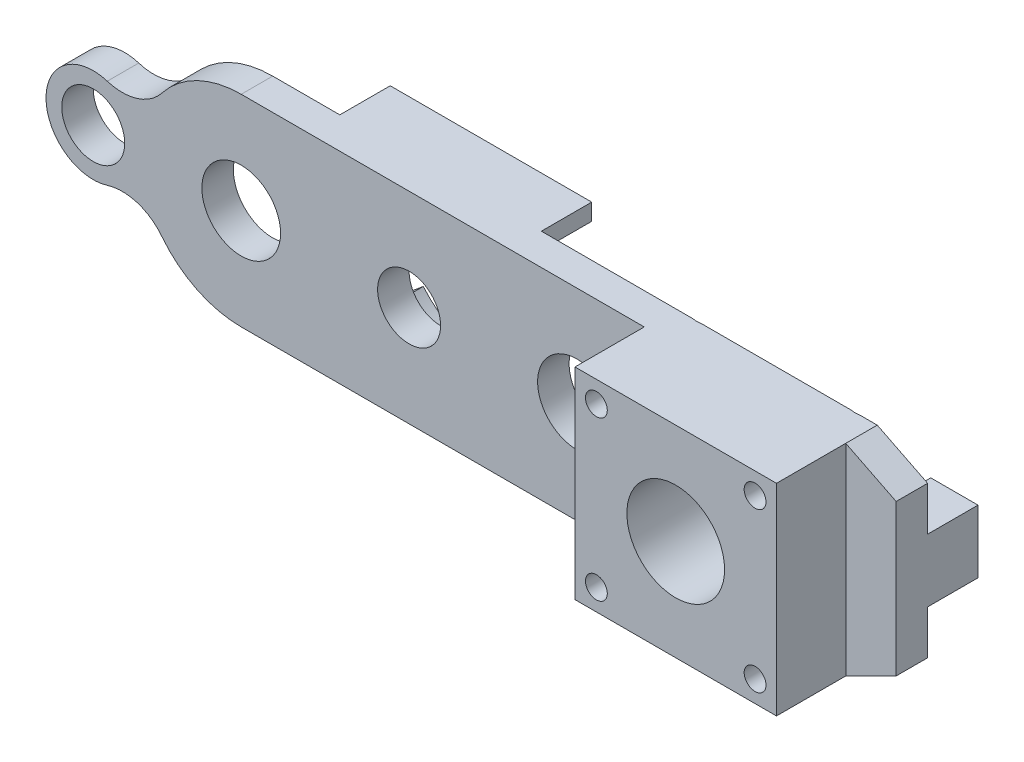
ISO-10303-21;
HEADER;
FILE_DESCRIPTION(('STEP AP214'),'2;1');
FILE_NAME('part.step','',(''),(''),'','','');
FILE_SCHEMA(('AUTOMOTIVE_DESIGN { 1 0 10303 214 1 1 1 1 }'));
ENDSEC;
DATA;
#1=APPLICATION_CONTEXT('core data for automotive mechanical design processes');
#2=APPLICATION_PROTOCOL_DEFINITION('international standard','automotive_design',2000,#1);
#3=PRODUCT_CONTEXT('',#1,'mechanical');
#4=PRODUCT('Part','Part','',(#3));
#5=PRODUCT_RELATED_PRODUCT_CATEGORY('part','',(#4));
#6=PRODUCT_DEFINITION_FORMATION('','',#4);
#7=PRODUCT_DEFINITION_CONTEXT('part definition',#1,'design');
#8=PRODUCT_DEFINITION('design','',#6,#7);
#9=PRODUCT_DEFINITION_SHAPE('','',#8);
#10=(LENGTH_UNIT() NAMED_UNIT(*) SI_UNIT(.MILLI.,.METRE.));
#11=(NAMED_UNIT(*) PLANE_ANGLE_UNIT() SI_UNIT($,.RADIAN.));
#12=(NAMED_UNIT(*) SI_UNIT($,.STERADIAN.) SOLID_ANGLE_UNIT());
#13=UNCERTAINTY_MEASURE_WITH_UNIT(LENGTH_MEASURE(1.E-05),#10,'distance_accuracy_value','');
#14=(GEOMETRIC_REPRESENTATION_CONTEXT(3) GLOBAL_UNCERTAINTY_ASSIGNED_CONTEXT((#13)) GLOBAL_UNIT_ASSIGNED_CONTEXT((#10,
#11,#12)) REPRESENTATION_CONTEXT('',''));
#15=CARTESIAN_POINT('',(0.,0.,0.));
#16=DIRECTION('',(0.,0.,1.));
#17=DIRECTION('',(1.,0.,0.));
#18=AXIS2_PLACEMENT_3D('',#15,#16,#17);
#19=CARTESIAN_POINT('',(-78.0374468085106,19.5578119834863,0.));
#20=DIRECTION('',(0.,0.,1.));
#21=DIRECTION('',(1.,0.,0.));
#22=AXIS2_PLACEMENT_3D('',#19,#20,#21);
#23=PLANE('',#22);
#24=CARTESIAN_POINT('',(-32.1818,10.16,0.));
#25=DIRECTION('',(0.,0.,1.));
#26=DIRECTION('',(1.,0.,0.));
#27=AXIS2_PLACEMENT_3D('',#24,#25,#26);
#28=CIRCLE('',#27,3.96875);
#29=CARTESIAN_POINT('',(-28.21305,10.16,0.));
#30=VERTEX_POINT('',#29);
#31=EDGE_CURVE('E566',#30,#30,#28,.T.);
#32=ORIENTED_EDGE('',*,*,#31,.T.);
#33=EDGE_LOOP('',(#32));
#34=FACE_BOUND('',#33,.T.);
#35=CARTESIAN_POINT('',(-80.9625,10.16,0.));
#36=DIRECTION('',(0.,0.,1.));
#37=DIRECTION('',(1.,0.,0.));
#38=AXIS2_PLACEMENT_3D('',#35,#36,#37);
#39=CIRCLE('',#38,3.175);
#40=CARTESIAN_POINT('',(-77.7875,10.16,0.));
#41=VERTEX_POINT('',#40);
#42=EDGE_CURVE('E576',#41,#41,#39,.T.);
#43=ORIENTED_EDGE('',*,*,#42,.T.);
#44=EDGE_LOOP('',(#43));
#45=FACE_BOUND('',#44,.T.);
#46=CARTESIAN_POINT('',(-66.04,10.16,0.));
#47=DIRECTION('',(0.,0.,1.));
#48=DIRECTION('',(1.,0.,0.));
#49=AXIS2_PLACEMENT_3D('',#46,#47,#48);
#50=CIRCLE('',#49,3.96875);
#51=CARTESIAN_POINT('',(-62.07125,10.16,0.));
#52=VERTEX_POINT('',#51);
#53=EDGE_CURVE('E580',#52,#52,#50,.T.);
#54=ORIENTED_EDGE('',*,*,#53,.T.);
#55=EDGE_LOOP('',(#54));
#56=FACE_BOUND('',#55,.T.);
#57=CARTESIAN_POINT('',(-15.24,10.16,0.));
#58=DIRECTION('',(0.,0.,1.));
#59=DIRECTION('',(1.,0.,0.));
#60=AXIS2_PLACEMENT_3D('',#57,#58,#59);
#61=CIRCLE('',#60,4.92589924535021);
#62=CARTESIAN_POINT('',(-10.3141007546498,10.16,0.));
#63=VERTEX_POINT('',#62);
#64=EDGE_CURVE('E571',#63,#63,#61,.T.);
#65=ORIENTED_EDGE('',*,*,#64,.T.);
#66=EDGE_LOOP('',(#65));
#67=FACE_BOUND('',#66,.T.);
#68=CARTESIAN_POINT('',(-49.1109,10.16,0.));
#69=DIRECTION('',(0.,0.,1.));
#70=DIRECTION('',(1.,0.,0.));
#71=AXIS2_PLACEMENT_3D('',#68,#69,#70);
#72=CIRCLE('',#71,3.175);
#73=CARTESIAN_POINT('',(-45.9359,10.16,0.));
#74=VERTEX_POINT('',#73);
#75=EDGE_CURVE('E559',#74,#74,#72,.T.);
#76=ORIENTED_EDGE('',*,*,#75,.T.);
#77=EDGE_LOOP('',(#76));
#78=FACE_BOUND('',#77,.T.);
#79=DIRECTION('',(-1.,0.,0.));
#80=VECTOR('',#79,1.);
#81=CARTESIAN_POINT('',(-4.7625,6.985,0.));
#82=LINE('',#81,#80);
#83=CARTESIAN_POINT('',(0.,6.985,0.));
#84=VERTEX_POINT('',#83);
#85=CARTESIAN_POINT('',(-4.7625,6.985,0.));
#86=VERTEX_POINT('',#85);
#87=EDGE_CURVE('E1034',#84,#86,#82,.T.);
#88=ORIENTED_EDGE('',*,*,#87,.F.);
#89=DIRECTION('',(0.,1.,0.));
#90=VECTOR('',#89,1.);
#91=CARTESIAN_POINT('',(0.,2.54000000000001,0.));
#92=LINE('',#91,#90);
#93=CARTESIAN_POINT('',(0.,2.54000000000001,0.));
#94=VERTEX_POINT('',#93);
#95=EDGE_CURVE('E276',#94,#84,#92,.T.);
#96=ORIENTED_EDGE('',*,*,#95,.F.);
#97=DIRECTION('',(0.894427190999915,0.44721359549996,0.));
#98=VECTOR('',#97,1.);
#99=CARTESIAN_POINT('',(-5.07999999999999,0.,0.));
#100=LINE('',#99,#98);
#101=CARTESIAN_POINT('',(-5.07999999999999,0.,0.));
#102=VERTEX_POINT('',#101);
#103=EDGE_CURVE('E628',#102,#94,#100,.T.);
#104=ORIENTED_EDGE('',*,*,#103,.F.);
#105=DIRECTION('',(1.,0.,0.));
#106=VECTOR('',#105,1.);
#107=CARTESIAN_POINT('',(-66.04,0.,0.));
#108=LINE('',#107,#106);
#109=CARTESIAN_POINT('',(-6.81624829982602,0.,0.));
#110=VERTEX_POINT('',#109);
#111=EDGE_CURVE('E625',#110,#102,#108,.T.);
#112=ORIENTED_EDGE('',*,*,#111,.F.);
#113=CARTESIAN_POINT('',(-7.23899999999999,2.159,0.));
#114=DIRECTION('',(0.,0.,-1.));
#115=DIRECTION('',(-1.,0.,0.));
#116=AXIS2_PLACEMENT_3D('',#113,#114,#115);
#117=CIRCLE('',#116,2.2);
#118=CARTESIAN_POINT('',(-7.66175170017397,0.,0.));
#119=VERTEX_POINT('',#118);
#120=EDGE_CURVE('E377',#119,#110,#117,.T.);
#121=ORIENTED_EDGE('',*,*,#120,.F.);
#122=CARTESIAN_POINT('',(-22.818248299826,0.,0.));
#123=VERTEX_POINT('',#122);
#124=EDGE_CURVE('E1042',#123,#119,#108,.T.);
#125=ORIENTED_EDGE('',*,*,#124,.F.);
#126=CARTESIAN_POINT('',(-23.241,2.15900000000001,0.));
#127=DIRECTION('',(0.,0.,-1.));
#128=DIRECTION('',(-1.,0.,0.));
#129=AXIS2_PLACEMENT_3D('',#126,#127,#128);
#130=CIRCLE('',#129,2.2);
#131=CARTESIAN_POINT('',(-23.663751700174,0.,0.));
#132=VERTEX_POINT('',#131);
#133=EDGE_CURVE('E371',#132,#123,#130,.T.);
#134=ORIENTED_EDGE('',*,*,#133,.F.);
#135=CARTESIAN_POINT('',(-38.9509,0.,0.));
#136=VERTEX_POINT('',#135);
#137=EDGE_CURVE('E629',#136,#132,#108,.T.);
#138=ORIENTED_EDGE('',*,*,#137,.F.);
#139=DIRECTION('',(0.,-1.,0.));
#140=VECTOR('',#139,1.);
#141=CARTESIAN_POINT('',(-38.9509,0.,0.));
#142=LINE('',#141,#140);
#143=CARTESIAN_POINT('',(-38.9509,1.67881198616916,0.));
#144=VERTEX_POINT('',#143);
#145=EDGE_CURVE('E289',#144,#136,#142,.T.);
#146=ORIENTED_EDGE('',*,*,#145,.F.);
#147=DIRECTION('',(0.767681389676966,-0.640831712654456,0.));
#148=VECTOR('',#147,1.);
#149=CARTESIAN_POINT('',(-38.9509,1.67881198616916,0.));
#150=LINE('',#149,#148);
#151=CARTESIAN_POINT('',(-42.2862124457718,4.46300607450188,0.));
#152=VERTEX_POINT('',#151);
#153=EDGE_CURVE('E302',#152,#144,#150,.T.);
#154=ORIENTED_EDGE('',*,*,#153,.F.);
#155=CARTESIAN_POINT('',(-49.1109,10.16,0.));
#156=DIRECTION('',(0.,0.,1.));
#157=DIRECTION('',(1.,0.,0.));
#158=AXIS2_PLACEMENT_3D('',#155,#156,#157);
#159=CIRCLE('',#158,8.89);
#160=CARTESIAN_POINT('',(-55.9355875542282,4.4630060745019,0.));
#161=VERTEX_POINT('',#160);
#162=EDGE_CURVE('E300',#161,#152,#159,.T.);
#163=ORIENTED_EDGE('',*,*,#162,.F.);
#164=DIRECTION('',(0.767681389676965,0.640831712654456,0.));
#165=VECTOR('',#164,1.);
#166=CARTESIAN_POINT('',(-59.2709,1.67881198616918,0.));
#167=LINE('',#166,#165);
#168=CARTESIAN_POINT('',(-59.2709,1.67881198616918,0.));
#169=VERTEX_POINT('',#168);
#170=EDGE_CURVE('E279',#169,#161,#167,.T.);
#171=ORIENTED_EDGE('',*,*,#170,.F.);
#172=DIRECTION('',(0.,1.,0.));
#173=VECTOR('',#172,1.);
#174=CARTESIAN_POINT('',(-59.2709,0.,0.));
#175=LINE('',#174,#173);
#176=CARTESIAN_POINT('',(-59.2709,0.,0.));
#177=VERTEX_POINT('',#176);
#178=EDGE_CURVE('E277',#177,#169,#175,.T.);
#179=ORIENTED_EDGE('',*,*,#178,.F.);
#180=CARTESIAN_POINT('',(-66.04,0.,0.));
#181=VERTEX_POINT('',#180);
#182=EDGE_CURVE('E626',#181,#177,#108,.T.);
#183=ORIENTED_EDGE('',*,*,#182,.F.);
#184=CARTESIAN_POINT('',(-66.04,10.16,0.));
#185=DIRECTION('',(0.,0.,1.));
#186=DIRECTION('',(1.,0.,0.));
#187=AXIS2_PLACEMENT_3D('',#184,#185,#186);
#188=CIRCLE('',#187,10.16);
#189=CARTESIAN_POINT('',(-74.0382978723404,3.89479201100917,0.));
#190=VERTEX_POINT('',#189);
#191=EDGE_CURVE('E623',#190,#181,#188,.T.);
#192=ORIENTED_EDGE('',*,*,#191,.F.);
#193=CARTESIAN_POINT('',(-78.0374468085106,0.762188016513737,0.));
#194=DIRECTION('',(0.,0.,-1.));
#195=DIRECTION('',(-1.,0.,0.));
#196=AXIS2_PLACEMENT_3D('',#193,#194,#195);
#197=CIRCLE('',#196,5.08);
#198=CARTESIAN_POINT('',(-79.5471516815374,5.61267162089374,0.));
#199=VERTEX_POINT('',#198);
#200=EDGE_CURVE('E621',#199,#190,#197,.T.);
#201=ORIENTED_EDGE('',*,*,#200,.F.);
#202=CARTESIAN_POINT('',(-80.9625,10.16,0.));
#203=DIRECTION('',(0.,0.,1.));
#204=DIRECTION('',(1.,0.,0.));
#205=AXIS2_PLACEMENT_3D('',#202,#203,#204);
#206=CIRCLE('',#205,4.7625);
#207=CARTESIAN_POINT('',(-79.5471516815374,14.7073283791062,0.));
#208=VERTEX_POINT('',#207);
#209=EDGE_CURVE('E619',#208,#199,#206,.T.);
#210=ORIENTED_EDGE('',*,*,#209,.F.);
#211=CARTESIAN_POINT('',(-78.0374468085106,19.5578119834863,0.));
#212=DIRECTION('',(0.,0.,-1.));
#213=DIRECTION('',(1.,0.,0.));
#214=AXIS2_PLACEMENT_3D('',#211,#212,#213);
#215=CIRCLE('',#214,5.07999999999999);
#216=CARTESIAN_POINT('',(-74.0382978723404,16.4252079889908,0.));
#217=VERTEX_POINT('',#216);
#218=EDGE_CURVE('E586',#217,#208,#215,.T.);
#219=ORIENTED_EDGE('',*,*,#218,.F.);
#220=CARTESIAN_POINT('',(-66.04,10.16,0.));
#221=DIRECTION('',(0.,0.,1.));
#222=DIRECTION('',(1.,0.,0.));
#223=AXIS2_PLACEMENT_3D('',#220,#221,#222);
#224=CIRCLE('',#223,10.16);
#225=CARTESIAN_POINT('',(-66.04,20.32,0.));
#226=VERTEX_POINT('',#225);
#227=EDGE_CURVE('E593',#226,#217,#224,.T.);
#228=ORIENTED_EDGE('',*,*,#227,.F.);
#229=DIRECTION('',(-1.,0.,0.));
#230=VECTOR('',#229,1.);
#231=CARTESIAN_POINT('',(-66.04,20.32,0.));
#232=LINE('',#231,#230);
#233=CARTESIAN_POINT('',(-59.2709,20.32,0.));
#234=VERTEX_POINT('',#233);
#235=EDGE_CURVE('E635',#234,#226,#232,.T.);
#236=ORIENTED_EDGE('',*,*,#235,.F.);
#237=DIRECTION('',(0.,1.,0.));
#238=VECTOR('',#237,1.);
#239=CARTESIAN_POINT('',(-59.2709,20.32,0.));
#240=LINE('',#239,#238);
#241=CARTESIAN_POINT('',(-59.2709,18.6411880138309,0.));
#242=VERTEX_POINT('',#241);
#243=EDGE_CURVE('E340',#242,#234,#240,.T.);
#244=ORIENTED_EDGE('',*,*,#243,.F.);
#245=DIRECTION('',(-0.767681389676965,0.640831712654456,0.));
#246=VECTOR('',#245,1.);
#247=CARTESIAN_POINT('',(-59.2709,18.6411880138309,0.));
#248=LINE('',#247,#246);
#249=CARTESIAN_POINT('',(-55.9355875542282,15.8569939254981,0.));
#250=VERTEX_POINT('',#249);
#251=EDGE_CURVE('E338',#250,#242,#248,.T.);
#252=ORIENTED_EDGE('',*,*,#251,.F.);
#253=CARTESIAN_POINT('',(-49.1109,10.16,0.));
#254=DIRECTION('',(0.,0.,1.));
#255=DIRECTION('',(-1.,0.,0.));
#256=AXIS2_PLACEMENT_3D('',#253,#254,#255);
#257=CIRCLE('',#256,8.89);
#258=CARTESIAN_POINT('',(-42.2862124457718,15.8569939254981,0.));
#259=VERTEX_POINT('',#258);
#260=EDGE_CURVE('E320',#259,#250,#257,.T.);
#261=ORIENTED_EDGE('',*,*,#260,.F.);
#262=DIRECTION('',(-0.767681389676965,-0.640831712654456,0.));
#263=VECTOR('',#262,1.);
#264=CARTESIAN_POINT('',(-38.9509,18.6411880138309,0.));
#265=LINE('',#264,#263);
#266=CARTESIAN_POINT('',(-38.9509,18.6411880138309,0.));
#267=VERTEX_POINT('',#266);
#268=EDGE_CURVE('E325',#267,#259,#265,.T.);
#269=ORIENTED_EDGE('',*,*,#268,.F.);
#270=DIRECTION('',(0.,-1.,0.));
#271=VECTOR('',#270,1.);
#272=CARTESIAN_POINT('',(-38.9509,20.32,0.));
#273=LINE('',#272,#271);
#274=CARTESIAN_POINT('',(-38.9509,20.32,0.));
#275=VERTEX_POINT('',#274);
#276=EDGE_CURVE('E343',#275,#267,#273,.T.);
#277=ORIENTED_EDGE('',*,*,#276,.F.);
#278=CARTESIAN_POINT('',(-23.6637517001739,20.32,0.));
#279=VERTEX_POINT('',#278);
#280=EDGE_CURVE('E640',#279,#275,#232,.T.);
#281=ORIENTED_EDGE('',*,*,#280,.F.);
#282=CARTESIAN_POINT('',(-23.241,18.161,0.));
#283=DIRECTION('',(0.,0.,-1.));
#284=DIRECTION('',(-1.,0.,0.));
#285=AXIS2_PLACEMENT_3D('',#282,#283,#284);
#286=CIRCLE('',#285,2.2);
#287=CARTESIAN_POINT('',(-22.8182482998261,20.32,0.));
#288=VERTEX_POINT('',#287);
#289=EDGE_CURVE('E365',#288,#279,#286,.T.);
#290=ORIENTED_EDGE('',*,*,#289,.F.);
#291=CARTESIAN_POINT('',(-7.66175170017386,20.32,0.));
#292=VERTEX_POINT('',#291);
#293=EDGE_CURVE('E639',#292,#288,#232,.T.);
#294=ORIENTED_EDGE('',*,*,#293,.F.);
#295=CARTESIAN_POINT('',(-7.239,18.161,0.));
#296=DIRECTION('',(0.,0.,-1.));
#297=DIRECTION('',(-1.,0.,0.));
#298=AXIS2_PLACEMENT_3D('',#295,#296,#297);
#299=CIRCLE('',#298,2.2);
#300=CARTESIAN_POINT('',(-6.81624829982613,20.32,0.));
#301=VERTEX_POINT('',#300);
#302=EDGE_CURVE('E360',#301,#292,#299,.T.);
#303=ORIENTED_EDGE('',*,*,#302,.F.);
#304=CARTESIAN_POINT('',(-5.07999999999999,20.32,0.));
#305=VERTEX_POINT('',#304);
#306=EDGE_CURVE('E636',#305,#301,#232,.T.);
#307=ORIENTED_EDGE('',*,*,#306,.F.);
#308=DIRECTION('',(-0.894427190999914,0.447213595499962,0.));
#309=VECTOR('',#308,1.);
#310=CARTESIAN_POINT('',(-5.07999999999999,20.32,0.));
#311=LINE('',#310,#309);
#312=CARTESIAN_POINT('',(0.,17.78,0.));
#313=VERTEX_POINT('',#312);
#314=EDGE_CURVE('E633',#313,#305,#311,.T.);
#315=ORIENTED_EDGE('',*,*,#314,.F.);
#316=CARTESIAN_POINT('',(0.,13.335,0.));
#317=VERTEX_POINT('',#316);
#318=EDGE_CURVE('E631',#317,#313,#92,.T.);
#319=ORIENTED_EDGE('',*,*,#318,.F.);
#320=DIRECTION('',(1.,0.,0.));
#321=VECTOR('',#320,1.);
#322=CARTESIAN_POINT('',(0.,13.335,0.));
#323=LINE('',#322,#321);
#324=CARTESIAN_POINT('',(-4.7625,13.335,0.));
#325=VERTEX_POINT('',#324);
#326=EDGE_CURVE('E270',#325,#317,#323,.T.);
#327=ORIENTED_EDGE('',*,*,#326,.F.);
#328=DIRECTION('',(0.,1.,0.));
#329=VECTOR('',#328,1.);
#330=CARTESIAN_POINT('',(-4.7625,13.335,0.));
#331=LINE('',#330,#329);
#332=EDGE_CURVE('E1022',#86,#325,#331,.T.);
#333=ORIENTED_EDGE('',*,*,#332,.F.);
#334=EDGE_LOOP('',(#88,#96,#104,#112,#121,#125,#134,#138,#146,#154,#163,#171,#179,#183,#192,
#201,#210,#219,#228,#236,#244,#252,#261,#269,#277,#281,#290,#294,#303,#307,#315,#319,#327,#333));
#335=FACE_BOUND('',#334,.T.);
#336=ADVANCED_FACE('F37',(#34,#45,#56,#67,#78,#335),#23,.F.);
#337=CARTESIAN_POINT('',(-78.0374468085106,19.5578119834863,3.175));
#338=DIRECTION('',(0.,0.,1.));
#339=DIRECTION('',(1.,0.,0.));
#340=AXIS2_PLACEMENT_3D('',#337,#338,#339);
#341=PLANE('',#340);
#342=DIRECTION('',(0.,1.,0.));
#343=VECTOR('',#342,1.);
#344=CARTESIAN_POINT('',(-5.07999999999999,20.32,3.175));
#345=LINE('',#344,#343);
#346=CARTESIAN_POINT('',(-5.07999999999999,0.,3.175));
#347=VERTEX_POINT('',#346);
#348=CARTESIAN_POINT('',(-5.07999999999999,20.32,3.175));
#349=VERTEX_POINT('',#348);
#350=EDGE_CURVE('E396',#347,#349,#345,.T.);
#351=ORIENTED_EDGE('',*,*,#350,.F.);
#352=DIRECTION('',(0.894427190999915,0.44721359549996,0.));
#353=VECTOR('',#352,1.);
#354=CARTESIAN_POINT('',(-5.07999999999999,0.,3.175));
#355=LINE('',#354,#353);
#356=CARTESIAN_POINT('',(0.,2.54000000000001,3.175));
#357=VERTEX_POINT('',#356);
#358=EDGE_CURVE('E602',#347,#357,#355,.T.);
#359=ORIENTED_EDGE('',*,*,#358,.T.);
#360=DIRECTION('',(0.,1.,0.));
#361=VECTOR('',#360,1.);
#362=CARTESIAN_POINT('',(0.,2.54000000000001,3.175));
#363=LINE('',#362,#361);
#364=CARTESIAN_POINT('',(0.,17.78,3.175));
#365=VERTEX_POINT('',#364);
#366=EDGE_CURVE('E1030',#357,#365,#363,.T.);
#367=ORIENTED_EDGE('',*,*,#366,.T.);
#368=DIRECTION('',(-0.894427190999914,0.447213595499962,0.));
#369=VECTOR('',#368,1.);
#370=CARTESIAN_POINT('',(-5.07999999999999,20.32,3.175));
#371=LINE('',#370,#369);
#372=EDGE_CURVE('E611',#365,#349,#371,.T.);
#373=ORIENTED_EDGE('',*,*,#372,.T.);
#374=EDGE_LOOP('',(#351,#359,#367,#373));
#375=FACE_BOUND('',#374,.T.);
#376=ADVANCED_FACE('F481',(#375),#341,.T.);
#377=DIRECTION('',(0.,-1.,0.));
#378=VECTOR('',#377,1.);
#379=CARTESIAN_POINT('',(-25.4,20.32,3.175));
#380=LINE('',#379,#378);
#381=CARTESIAN_POINT('',(-25.4,20.32,3.175));
#382=VERTEX_POINT('',#381);
#383=CARTESIAN_POINT('',(-25.4,0.,3.175));
#384=VERTEX_POINT('',#383);
#385=EDGE_CURVE('E399',#382,#384,#380,.T.);
#386=ORIENTED_EDGE('',*,*,#385,.F.);
#387=DIRECTION('',(-1.,0.,0.));
#388=VECTOR('',#387,1.);
#389=CARTESIAN_POINT('',(-66.04,20.32,3.175));
#390=LINE('',#389,#388);
#391=CARTESIAN_POINT('',(-66.04,20.32,3.175));
#392=VERTEX_POINT('',#391);
#393=EDGE_CURVE('E608',#382,#392,#390,.T.);
#394=ORIENTED_EDGE('',*,*,#393,.T.);
#395=CARTESIAN_POINT('',(-66.04,10.16,3.175));
#396=DIRECTION('',(0.,0.,1.));
#397=DIRECTION('',(1.,0.,0.));
#398=AXIS2_PLACEMENT_3D('',#395,#396,#397);
#399=CIRCLE('',#398,10.16);
#400=CARTESIAN_POINT('',(-74.0382978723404,16.4252079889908,3.175));
#401=VERTEX_POINT('',#400);
#402=EDGE_CURVE('E610',#392,#401,#399,.T.);
#403=ORIENTED_EDGE('',*,*,#402,.T.);
#404=CARTESIAN_POINT('',(-78.0374468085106,19.5578119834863,3.175));
#405=DIRECTION('',(0.,0.,-1.));
#406=DIRECTION('',(1.,0.,0.));
#407=AXIS2_PLACEMENT_3D('',#404,#405,#406);
#408=CIRCLE('',#407,5.07999999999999);
#409=CARTESIAN_POINT('',(-79.5471516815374,14.7073283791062,3.175));
#410=VERTEX_POINT('',#409);
#411=EDGE_CURVE('E589',#401,#410,#408,.T.);
#412=ORIENTED_EDGE('',*,*,#411,.T.);
#413=CARTESIAN_POINT('',(-80.9625,10.16,3.175));
#414=DIRECTION('',(0.,0.,1.));
#415=DIRECTION('',(1.,0.,0.));
#416=AXIS2_PLACEMENT_3D('',#413,#414,#415);
#417=CIRCLE('',#416,4.7625);
#418=CARTESIAN_POINT('',(-79.5471516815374,5.61267162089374,3.175));
#419=VERTEX_POINT('',#418);
#420=EDGE_CURVE('E592',#410,#419,#417,.T.);
#421=ORIENTED_EDGE('',*,*,#420,.T.);
#422=CARTESIAN_POINT('',(-78.0374468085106,0.762188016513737,3.175));
#423=DIRECTION('',(0.,0.,-1.));
#424=DIRECTION('',(-1.,0.,0.));
#425=AXIS2_PLACEMENT_3D('',#422,#423,#424);
#426=CIRCLE('',#425,5.08);
#427=CARTESIAN_POINT('',(-74.0382978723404,3.89479201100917,3.175));
#428=VERTEX_POINT('',#427);
#429=EDGE_CURVE('E595',#419,#428,#426,.T.);
#430=ORIENTED_EDGE('',*,*,#429,.T.);
#431=CARTESIAN_POINT('',(-66.04,10.16,3.175));
#432=DIRECTION('',(0.,0.,1.));
#433=DIRECTION('',(1.,0.,0.));
#434=AXIS2_PLACEMENT_3D('',#431,#432,#433);
#435=CIRCLE('',#434,10.16);
#436=CARTESIAN_POINT('',(-66.04,0.,3.175));
#437=VERTEX_POINT('',#436);
#438=EDGE_CURVE('E597',#428,#437,#435,.T.);
#439=ORIENTED_EDGE('',*,*,#438,.T.);
#440=DIRECTION('',(1.,0.,0.));
#441=VECTOR('',#440,1.);
#442=CARTESIAN_POINT('',(-66.04,0.,3.175));
#443=LINE('',#442,#441);
#444=EDGE_CURVE('E599',#437,#384,#443,.T.);
#445=ORIENTED_EDGE('',*,*,#444,.T.);
#446=EDGE_LOOP('',(#386,#394,#403,#412,#421,#430,#439,#445));
#447=FACE_BOUND('',#446,.T.);
#448=CARTESIAN_POINT('',(-32.1818,10.16,3.175));
#449=DIRECTION('',(0.,0.,1.));
#450=DIRECTION('',(1.,0.,0.));
#451=AXIS2_PLACEMENT_3D('',#448,#449,#450);
#452=CIRCLE('',#451,3.96875);
#453=CARTESIAN_POINT('',(-28.21305,10.16,3.175));
#454=VERTEX_POINT('',#453);
#455=EDGE_CURVE('E568',#454,#454,#452,.T.);
#456=ORIENTED_EDGE('',*,*,#455,.F.);
#457=EDGE_LOOP('',(#456));
#458=FACE_BOUND('',#457,.T.);
#459=CARTESIAN_POINT('',(-80.9625,10.16,3.175));
#460=DIRECTION('',(0.,0.,1.));
#461=DIRECTION('',(1.,0.,0.));
#462=AXIS2_PLACEMENT_3D('',#459,#460,#461);
#463=CIRCLE('',#462,3.175);
#464=CARTESIAN_POINT('',(-77.7875,10.16,3.175));
#465=VERTEX_POINT('',#464);
#466=EDGE_CURVE('E577',#465,#465,#463,.T.);
#467=ORIENTED_EDGE('',*,*,#466,.F.);
#468=EDGE_LOOP('',(#467));
#469=FACE_BOUND('',#468,.T.);
#470=CARTESIAN_POINT('',(-66.04,10.16,3.175));
#471=DIRECTION('',(0.,0.,1.));
#472=DIRECTION('',(1.,0.,0.));
#473=AXIS2_PLACEMENT_3D('',#470,#471,#472);
#474=CIRCLE('',#473,3.96875);
#475=CARTESIAN_POINT('',(-62.07125,10.16,3.175));
#476=VERTEX_POINT('',#475);
#477=EDGE_CURVE('E583',#476,#476,#474,.T.);
#478=ORIENTED_EDGE('',*,*,#477,.F.);
#479=EDGE_LOOP('',(#478));
#480=FACE_BOUND('',#479,.T.);
#481=CARTESIAN_POINT('',(-49.1109,10.16,3.175));
#482=DIRECTION('',(0.,0.,1.));
#483=DIRECTION('',(1.,0.,0.));
#484=AXIS2_PLACEMENT_3D('',#481,#482,#483);
#485=CIRCLE('',#484,3.175);
#486=CARTESIAN_POINT('',(-45.9359,10.16,3.175));
#487=VERTEX_POINT('',#486);
#488=EDGE_CURVE('E561',#487,#487,#485,.T.);
#489=ORIENTED_EDGE('',*,*,#488,.F.);
#490=EDGE_LOOP('',(#489));
#491=FACE_BOUND('',#490,.T.);
#492=ADVANCED_FACE('F478',(#447,#458,#469,#480,#491),#341,.T.);
#493=CARTESIAN_POINT('',(-78.0374468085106,19.5578119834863,3.175));
#494=DIRECTION('',(0.,0.,-1.));
#495=DIRECTION('',(-1.,0.,0.));
#496=AXIS2_PLACEMENT_3D('',#493,#494,#495);
#497=CYLINDRICAL_SURFACE('',#496,5.07999999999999);
#498=ORIENTED_EDGE('',*,*,#218,.T.);
#499=DIRECTION('',(0.,0.,-1.));
#500=VECTOR('',#499,1.);
#501=CARTESIAN_POINT('',(-79.5471516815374,14.7073283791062,3.175));
#502=LINE('',#501,#500);
#503=EDGE_CURVE('E426',#410,#208,#502,.T.);
#504=ORIENTED_EDGE('',*,*,#503,.F.);
#505=ORIENTED_EDGE('',*,*,#411,.F.);
#506=DIRECTION('',(0.,0.,-1.));
#507=VECTOR('',#506,1.);
#508=CARTESIAN_POINT('',(-74.0382978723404,16.4252079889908,3.175));
#509=LINE('',#508,#507);
#510=EDGE_CURVE('E616',#401,#217,#509,.T.);
#511=ORIENTED_EDGE('',*,*,#510,.T.);
#512=EDGE_LOOP('',(#498,#504,#505,#511));
#513=FACE_BOUND('',#512,.T.);
#514=ADVANCED_FACE('F39',(#513),#497,.F.);
#515=CARTESIAN_POINT('',(-80.9625,10.16,3.175));
#516=DIRECTION('',(0.,0.,-1.));
#517=DIRECTION('',(-1.,0.,0.));
#518=AXIS2_PLACEMENT_3D('',#515,#516,#517);
#519=CYLINDRICAL_SURFACE('',#518,4.7625);
#520=ORIENTED_EDGE('',*,*,#209,.T.);
#521=DIRECTION('',(0.,0.,-1.));
#522=VECTOR('',#521,1.);
#523=CARTESIAN_POINT('',(-79.5471516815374,5.61267162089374,3.175));
#524=LINE('',#523,#522);
#525=EDGE_CURVE('E660',#419,#199,#524,.T.);
#526=ORIENTED_EDGE('',*,*,#525,.F.);
#527=ORIENTED_EDGE('',*,*,#420,.F.);
#528=ORIENTED_EDGE('',*,*,#503,.T.);
#529=EDGE_LOOP('',(#520,#526,#527,#528));
#530=FACE_BOUND('',#529,.T.);
#531=ADVANCED_FACE('F669',(#530),#519,.T.);
#532=CARTESIAN_POINT('',(-78.0374468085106,0.762188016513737,3.175));
#533=DIRECTION('',(0.,0.,-1.));
#534=DIRECTION('',(-1.,0.,0.));
#535=AXIS2_PLACEMENT_3D('',#532,#533,#534);
#536=CYLINDRICAL_SURFACE('',#535,5.08);
#537=ORIENTED_EDGE('',*,*,#200,.T.);
#538=DIRECTION('',(0.,0.,-1.));
#539=VECTOR('',#538,1.);
#540=CARTESIAN_POINT('',(-74.0382978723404,3.89479201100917,3.175));
#541=LINE('',#540,#539);
#542=EDGE_CURVE('E658',#428,#190,#541,.T.);
#543=ORIENTED_EDGE('',*,*,#542,.F.);
#544=ORIENTED_EDGE('',*,*,#429,.F.);
#545=ORIENTED_EDGE('',*,*,#525,.T.);
#546=EDGE_LOOP('',(#537,#543,#544,#545));
#547=FACE_BOUND('',#546,.T.);
#548=ADVANCED_FACE('F680',(#547),#536,.F.);
#549=CARTESIAN_POINT('',(-66.04,10.16,3.175));
#550=DIRECTION('',(0.,0.,-1.));
#551=DIRECTION('',(-1.,0.,0.));
#552=AXIS2_PLACEMENT_3D('',#549,#550,#551);
#553=CYLINDRICAL_SURFACE('',#552,10.16);
#554=ORIENTED_EDGE('',*,*,#191,.T.);
#555=DIRECTION('',(0.,0.,-1.));
#556=VECTOR('',#555,1.);
#557=CARTESIAN_POINT('',(-66.04,0.,3.175));
#558=LINE('',#557,#556);
#559=EDGE_CURVE('E655',#437,#181,#558,.T.);
#560=ORIENTED_EDGE('',*,*,#559,.F.);
#561=ORIENTED_EDGE('',*,*,#438,.F.);
#562=ORIENTED_EDGE('',*,*,#542,.T.);
#563=EDGE_LOOP('',(#554,#560,#561,#562));
#564=FACE_BOUND('',#563,.T.);
#565=ADVANCED_FACE('F683',(#564),#553,.T.);
#566=CARTESIAN_POINT('',(-66.04,0.,3.175));
#567=DIRECTION('',(0.,1.,0.));
#568=DIRECTION('',(-1.,0.,0.));
#569=AXIS2_PLACEMENT_3D('',#566,#567,#568);
#570=PLANE('',#569);
#571=ORIENTED_EDGE('',*,*,#182,.T.);
#572=DIRECTION('',(0.,0.,1.));
#573=VECTOR('',#572,1.);
#574=CARTESIAN_POINT('',(-59.2709,0.,-5.08));
#575=LINE('',#574,#573);
#576=CARTESIAN_POINT('',(-59.2709,0.,-5.08));
#577=VERTEX_POINT('',#576);
#578=EDGE_CURVE('E318',#577,#177,#575,.T.);
#579=ORIENTED_EDGE('',*,*,#578,.F.);
#580=DIRECTION('',(-1.,0.,0.));
#581=VECTOR('',#580,1.);
#582=CARTESIAN_POINT('',(-59.2709,0.,-5.08));
#583=LINE('',#582,#581);
#584=CARTESIAN_POINT('',(-38.9509,0.,-5.08));
#585=VERTEX_POINT('',#584);
#586=EDGE_CURVE('E285',#585,#577,#583,.T.);
#587=ORIENTED_EDGE('',*,*,#586,.F.);
#588=DIRECTION('',(0.,0.,1.));
#589=VECTOR('',#588,1.);
#590=CARTESIAN_POINT('',(-38.9509,0.,-5.08));
#591=LINE('',#590,#589);
#592=EDGE_CURVE('E61',#585,#136,#591,.T.);
#593=ORIENTED_EDGE('',*,*,#592,.T.);
#594=ORIENTED_EDGE('',*,*,#137,.T.);
#595=CARTESIAN_POINT('',(-23.6647912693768,0.,-0.000200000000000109));
#596=CARTESIAN_POINT('',(-23.6109499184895,0.,0.0101956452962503));
#597=CARTESIAN_POINT('',(-23.5567305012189,0.,0.0187127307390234));
#598=CARTESIAN_POINT('',(-23.4477943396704,0.,0.0317865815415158));
#599=CARTESIAN_POINT('',(-23.393077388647,0.,0.0363416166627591));
#600=CARTESIAN_POINT('',(-23.2842169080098,0.,0.0412443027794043));
#601=CARTESIAN_POINT('',(-23.2300760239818,0.,0.041649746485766));
#602=CARTESIAN_POINT('',(-23.1219418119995,0.,0.0383943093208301));
#603=CARTESIAN_POINT('',(-23.0679484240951,0.,0.0347354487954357));
#604=CARTESIAN_POINT('',(-22.981219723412,0.,0.025674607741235));
#605=CARTESIAN_POINT('',(-22.9483506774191,0.,0.0214966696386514));
#606=CARTESIAN_POINT('',(-22.8826798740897,0.,0.0117098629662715));
#607=CARTESIAN_POINT('',(-22.8498790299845,0.,0.00609485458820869));
#608=CARTESIAN_POINT('',(-22.8172087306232,0.,-0.00020000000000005));
#609=B_SPLINE_CURVE_WITH_KNOTS('',3,(#595,#596,#597,#598,#599,#600,#601,#602,#603,#604,#605,
#606,#607,#608),.UNSPECIFIED.,.F.,.F.,(4,2,2,2,2,2,4),(0.,0.164497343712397,0.329066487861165,
0.491340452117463,0.653533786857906,0.752906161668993,0.852710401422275),.UNSPECIFIED.);
#610=EDGE_CURVE('E425',#132,#123,#609,.T.);
#611=ORIENTED_EDGE('',*,*,#610,.T.);
#612=ORIENTED_EDGE('',*,*,#124,.T.);
#613=CARTESIAN_POINT('',(-7.66279126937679,0.,-0.000200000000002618));
#614=CARTESIAN_POINT('',(-7.6089499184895,0.,0.0101956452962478));
#615=CARTESIAN_POINT('',(-7.55473050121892,0.,0.0187127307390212));
#616=CARTESIAN_POINT('',(-7.44579433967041,0.,0.0317865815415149));
#617=CARTESIAN_POINT('',(-7.39107738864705,0.,0.036341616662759));
#618=CARTESIAN_POINT('',(-7.28221690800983,0.,0.0412443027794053));
#619=CARTESIAN_POINT('',(-7.22807602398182,0.,0.0416497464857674));
#620=CARTESIAN_POINT('',(-7.11994181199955,0.,0.0383943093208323));
#621=CARTESIAN_POINT('',(-7.06594842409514,0.,0.0347354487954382));
#622=CARTESIAN_POINT('',(-6.97921972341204,0.,0.025674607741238));
#623=CARTESIAN_POINT('',(-6.94635067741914,0.,0.0214966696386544));
#624=CARTESIAN_POINT('',(-6.88067987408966,0.,0.0117098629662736));
#625=CARTESIAN_POINT('',(-6.84787902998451,0.,0.00609485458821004));
#626=CARTESIAN_POINT('',(-6.81520873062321,0.,-0.000200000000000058));
#627=B_SPLINE_CURVE_WITH_KNOTS('',3,(#613,#614,#615,#616,#617,#618,#619,#620,#621,#622,#623,
#624,#625,#626),.UNSPECIFIED.,.F.,.F.,(4,2,2,2,2,2,4),(0.,0.164497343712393,0.329066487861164,
0.491340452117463,0.653533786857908,0.752906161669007,0.852710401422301),.UNSPECIFIED.);
#628=EDGE_CURVE('E417',#119,#110,#627,.T.);
#629=ORIENTED_EDGE('',*,*,#628,.T.);
#630=ORIENTED_EDGE('',*,*,#111,.T.);
#631=DIRECTION('',(0.,0.,-1.));
#632=VECTOR('',#631,1.);
#633=CARTESIAN_POINT('',(-5.07999999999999,0.,3.175));
#634=LINE('',#633,#632);
#635=EDGE_CURVE('E554',#347,#102,#634,.T.);
#636=ORIENTED_EDGE('',*,*,#635,.F.);
#637=DIRECTION('',(0.,0.,-1.));
#638=VECTOR('',#637,1.);
#639=CARTESIAN_POINT('',(-5.07999999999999,0.,49.0568195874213));
#640=LINE('',#639,#638);
#641=CARTESIAN_POINT('',(-5.07999999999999,0.,10.16));
#642=VERTEX_POINT('',#641);
#643=EDGE_CURVE('E402',#642,#347,#640,.T.);
#644=ORIENTED_EDGE('',*,*,#643,.F.);
#645=DIRECTION('',(1.,0.,0.));
#646=VECTOR('',#645,1.);
#647=CARTESIAN_POINT('',(-5.07999999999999,0.,10.16));
#648=LINE('',#647,#646);
#649=CARTESIAN_POINT('',(-25.4,0.,10.16));
#650=VERTEX_POINT('',#649);
#651=EDGE_CURVE('E383',#650,#642,#648,.T.);
#652=ORIENTED_EDGE('',*,*,#651,.F.);
#653=DIRECTION('',(0.,0.,-1.));
#654=VECTOR('',#653,1.);
#655=CARTESIAN_POINT('',(-25.4,0.,49.0568195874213));
#656=LINE('',#655,#654);
#657=EDGE_CURVE('E414',#650,#384,#656,.T.);
#658=ORIENTED_EDGE('',*,*,#657,.T.);
#659=ORIENTED_EDGE('',*,*,#444,.F.);
#660=ORIENTED_EDGE('',*,*,#559,.T.);
#661=EDGE_LOOP('',(#571,#579,#587,#593,#594,#611,#612,#629,#630,#636,#644,#652,#658,#659,#660));
#662=FACE_BOUND('',#661,.T.);
#663=ADVANCED_FACE('F428',(#662),#570,.F.);
#664=CARTESIAN_POINT('',(-5.07999999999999,0.,3.175));
#665=DIRECTION('',(-0.44721359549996,0.894427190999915,0.));
#666=DIRECTION('',(-0.894427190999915,-0.44721359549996,0.));
#667=AXIS2_PLACEMENT_3D('',#664,#665,#666);
#668=PLANE('',#667);
#669=ORIENTED_EDGE('',*,*,#103,.T.);
#670=DIRECTION('',(0.,0.,-1.));
#671=VECTOR('',#670,1.);
#672=CARTESIAN_POINT('',(0.,2.54000000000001,3.175));
#673=LINE('',#672,#671);
#674=EDGE_CURVE('E652',#357,#94,#673,.T.);
#675=ORIENTED_EDGE('',*,*,#674,.F.);
#676=ORIENTED_EDGE('',*,*,#358,.F.);
#677=ORIENTED_EDGE('',*,*,#635,.T.);
#678=EDGE_LOOP('',(#669,#675,#676,#677));
#679=FACE_BOUND('',#678,.T.);
#680=ADVANCED_FACE('F832',(#679),#668,.F.);
#681=CARTESIAN_POINT('',(0.,2.54000000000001,3.175));
#682=DIRECTION('',(-1.,0.,0.));
#683=DIRECTION('',(0.,-1.,0.));
#684=AXIS2_PLACEMENT_3D('',#681,#682,#683);
#685=PLANE('',#684);
#686=ORIENTED_EDGE('',*,*,#95,.T.);
#687=DIRECTION('',(0.,0.,1.));
#688=VECTOR('',#687,1.);
#689=CARTESIAN_POINT('',(0.,6.985,-5.08));
#690=LINE('',#689,#688);
#691=CARTESIAN_POINT('',(0.,6.985,-5.08));
#692=VERTEX_POINT('',#691);
#693=EDGE_CURVE('E258',#692,#84,#690,.T.);
#694=ORIENTED_EDGE('',*,*,#693,.F.);
#695=DIRECTION('',(0.,-1.,0.));
#696=VECTOR('',#695,1.);
#697=CARTESIAN_POINT('',(0.,6.985,-5.08));
#698=LINE('',#697,#696);
#699=CARTESIAN_POINT('',(0.,13.335,-5.08));
#700=VERTEX_POINT('',#699);
#701=EDGE_CURVE('E265',#700,#692,#698,.T.);
#702=ORIENTED_EDGE('',*,*,#701,.F.);
#703=DIRECTION('',(0.,0.,1.));
#704=VECTOR('',#703,1.);
#705=CARTESIAN_POINT('',(0.,13.335,-5.08));
#706=LINE('',#705,#704);
#707=EDGE_CURVE('E53',#700,#317,#706,.T.);
#708=ORIENTED_EDGE('',*,*,#707,.T.);
#709=ORIENTED_EDGE('',*,*,#318,.T.);
#710=DIRECTION('',(0.,0.,-1.));
#711=VECTOR('',#710,1.);
#712=CARTESIAN_POINT('',(0.,17.78,3.175));
#713=LINE('',#712,#711);
#714=EDGE_CURVE('E649',#365,#313,#713,.T.);
#715=ORIENTED_EDGE('',*,*,#714,.F.);
#716=ORIENTED_EDGE('',*,*,#366,.F.);
#717=ORIENTED_EDGE('',*,*,#674,.T.);
#718=EDGE_LOOP('',(#686,#694,#702,#708,#709,#715,#716,#717));
#719=FACE_BOUND('',#718,.T.);
#720=ADVANCED_FACE('F273',(#719),#685,.F.);
#721=CARTESIAN_POINT('',(-5.07999999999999,20.32,3.175));
#722=DIRECTION('',(-0.447213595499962,-0.894427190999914,0.));
#723=DIRECTION('',(0.894427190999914,-0.447213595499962,0.));
#724=AXIS2_PLACEMENT_3D('',#721,#722,#723);
#725=PLANE('',#724);
#726=ORIENTED_EDGE('',*,*,#314,.T.);
#727=DIRECTION('',(0.,0.,-1.));
#728=VECTOR('',#727,1.);
#729=CARTESIAN_POINT('',(-5.07999999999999,20.32,3.175));
#730=LINE('',#729,#728);
#731=EDGE_CURVE('E647',#349,#305,#730,.T.);
#732=ORIENTED_EDGE('',*,*,#731,.F.);
#733=ORIENTED_EDGE('',*,*,#372,.F.);
#734=ORIENTED_EDGE('',*,*,#714,.T.);
#735=EDGE_LOOP('',(#726,#732,#733,#734));
#736=FACE_BOUND('',#735,.T.);
#737=ADVANCED_FACE('F493',(#736),#725,.F.);
#738=CARTESIAN_POINT('',(-66.04,20.32,3.175));
#739=DIRECTION('',(0.,-1.,0.));
#740=DIRECTION('',(1.,0.,0.));
#741=AXIS2_PLACEMENT_3D('',#738,#739,#740);
#742=PLANE('',#741);
#743=ORIENTED_EDGE('',*,*,#306,.T.);
#744=CARTESIAN_POINT('',(-6.81520873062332,20.32,-0.00020000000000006));
#745=CARTESIAN_POINT('',(-6.86905008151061,20.32,0.0101956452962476));
#746=CARTESIAN_POINT('',(-6.92326949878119,20.32,0.0187127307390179));
#747=CARTESIAN_POINT('',(-7.0322056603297,20.32,0.0317865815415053));
#748=CARTESIAN_POINT('',(-7.08692261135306,20.32,0.0363416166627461));
#749=CARTESIAN_POINT('',(-7.19578309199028,20.32,0.0412443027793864));
#750=CARTESIAN_POINT('',(-7.24992397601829,20.32,0.0416497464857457));
#751=CARTESIAN_POINT('',(-7.35805818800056,20.32,0.0383943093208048));
#752=CARTESIAN_POINT('',(-7.41205157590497,20.32,0.0347354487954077));
#753=CARTESIAN_POINT('',(-7.49878027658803,20.32,0.0256746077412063));
#754=CARTESIAN_POINT('',(-7.5316493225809,20.32,0.0214966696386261));
#755=CARTESIAN_POINT('',(-7.59732012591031,20.32,0.0117098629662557));
#756=CARTESIAN_POINT('',(-7.63012097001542,20.32,0.00609485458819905));
#757=CARTESIAN_POINT('',(-7.66279126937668,20.32,-0.00020000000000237));
#758=B_SPLINE_CURVE_WITH_KNOTS('',3,(#744,#745,#746,#747,#748,#749,#750,#751,#752,#753,#754,
#755,#756,#757),.UNSPECIFIED.,.F.,.F.,(4,2,2,2,2,2,4),(0.,0.164497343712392,0.329066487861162,
0.491340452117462,0.653533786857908,0.752906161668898,0.852710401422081),.UNSPECIFIED.);
#759=EDGE_CURVE('E12',#301,#292,#758,.T.);
#760=ORIENTED_EDGE('',*,*,#759,.T.);
#761=ORIENTED_EDGE('',*,*,#293,.T.);
#762=CARTESIAN_POINT('',(-22.8172087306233,20.32,-0.000200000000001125));
#763=CARTESIAN_POINT('',(-22.8710500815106,20.32,0.0101956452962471));
#764=CARTESIAN_POINT('',(-22.9252694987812,20.32,0.0187127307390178));
#765=CARTESIAN_POINT('',(-23.0342056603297,20.32,0.0317865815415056));
#766=CARTESIAN_POINT('',(-23.0889226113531,20.32,0.0363416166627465));
#767=CARTESIAN_POINT('',(-23.1977830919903,20.32,0.0412443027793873));
#768=CARTESIAN_POINT('',(-23.2519239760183,20.32,0.0416497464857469));
#769=CARTESIAN_POINT('',(-23.3600581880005,20.32,0.0383943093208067));
#770=CARTESIAN_POINT('',(-23.414051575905,20.32,0.0347354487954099));
#771=CARTESIAN_POINT('',(-23.500780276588,20.32,0.0256746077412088));
#772=CARTESIAN_POINT('',(-23.5336493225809,20.32,0.0214966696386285));
#773=CARTESIAN_POINT('',(-23.5993201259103,20.32,0.0117098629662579));
#774=CARTESIAN_POINT('',(-23.6321209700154,20.32,0.00609485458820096));
#775=CARTESIAN_POINT('',(-23.6647912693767,20.32,-0.000200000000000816));
#776=B_SPLINE_CURVE_WITH_KNOTS('',3,(#762,#763,#764,#765,#766,#767,#768,#769,#770,#771,#772,
#773,#774,#775),.UNSPECIFIED.,.F.,.F.,(4,2,2,2,2,2,4),(0.,0.164497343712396,0.329066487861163,
0.491340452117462,0.653533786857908,0.752906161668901,0.852710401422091),.UNSPECIFIED.);
#777=EDGE_CURVE('E46',#288,#279,#776,.T.);
#778=ORIENTED_EDGE('',*,*,#777,.T.);
#779=ORIENTED_EDGE('',*,*,#280,.T.);
#780=DIRECTION('',(0.,0.,1.));
#781=VECTOR('',#780,1.);
#782=CARTESIAN_POINT('',(-38.9509,20.32,-5.08));
#783=LINE('',#782,#781);
#784=CARTESIAN_POINT('',(-38.9509,20.32,-5.08));
#785=VERTEX_POINT('',#784);
#786=EDGE_CURVE('E351',#785,#275,#783,.T.);
#787=ORIENTED_EDGE('',*,*,#786,.F.);
#788=DIRECTION('',(1.,0.,0.));
#789=VECTOR('',#788,1.);
#790=CARTESIAN_POINT('',(-59.2709,20.32,-5.08));
#791=LINE('',#790,#789);
#792=CARTESIAN_POINT('',(-59.2709,20.32,-5.08));
#793=VERTEX_POINT('',#792);
#794=EDGE_CURVE('E329',#793,#785,#791,.T.);
#795=ORIENTED_EDGE('',*,*,#794,.F.);
#796=DIRECTION('',(0.,0.,1.));
#797=VECTOR('',#796,1.);
#798=CARTESIAN_POINT('',(-59.2709,20.32,-5.08));
#799=LINE('',#798,#797);
#800=EDGE_CURVE('E353',#793,#234,#799,.T.);
#801=ORIENTED_EDGE('',*,*,#800,.T.);
#802=ORIENTED_EDGE('',*,*,#235,.T.);
#803=DIRECTION('',(0.,0.,-1.));
#804=VECTOR('',#803,1.);
#805=CARTESIAN_POINT('',(-66.04,20.32,3.175));
#806=LINE('',#805,#804);
#807=EDGE_CURVE('E644',#392,#226,#806,.T.);
#808=ORIENTED_EDGE('',*,*,#807,.F.);
#809=ORIENTED_EDGE('',*,*,#393,.F.);
#810=DIRECTION('',(0.,0.,-1.));
#811=VECTOR('',#810,1.);
#812=CARTESIAN_POINT('',(-25.4,20.32,49.0568195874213));
#813=LINE('',#812,#811);
#814=CARTESIAN_POINT('',(-25.4,20.32,10.16));
#815=VERTEX_POINT('',#814);
#816=EDGE_CURVE('E410',#815,#382,#813,.T.);
#817=ORIENTED_EDGE('',*,*,#816,.F.);
#818=DIRECTION('',(-1.,0.,0.));
#819=VECTOR('',#818,1.);
#820=CARTESIAN_POINT('',(-5.07999999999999,20.32,10.16));
#821=LINE('',#820,#819);
#822=CARTESIAN_POINT('',(-5.07999999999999,20.32,10.16));
#823=VERTEX_POINT('',#822);
#824=EDGE_CURVE('E390',#823,#815,#821,.T.);
#825=ORIENTED_EDGE('',*,*,#824,.F.);
#826=DIRECTION('',(0.,0.,-1.));
#827=VECTOR('',#826,1.);
#828=CARTESIAN_POINT('',(-5.07999999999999,20.32,49.0568195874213));
#829=LINE('',#828,#827);
#830=EDGE_CURVE('E413',#823,#349,#829,.T.);
#831=ORIENTED_EDGE('',*,*,#830,.T.);
#832=ORIENTED_EDGE('',*,*,#731,.T.);
#833=EDGE_LOOP('',(#743,#760,#761,#778,#779,#787,#795,#801,#802,#808,#809,#817,#825,#831,#832));
#834=FACE_BOUND('',#833,.T.);
#835=ADVANCED_FACE('F488',(#834),#742,.F.);
#836=CARTESIAN_POINT('',(-66.04,10.16,3.175));
#837=DIRECTION('',(0.,0.,-1.));
#838=DIRECTION('',(-1.,0.,0.));
#839=AXIS2_PLACEMENT_3D('',#836,#837,#838);
#840=CYLINDRICAL_SURFACE('',#839,10.16);
#841=ORIENTED_EDGE('',*,*,#227,.T.);
#842=ORIENTED_EDGE('',*,*,#510,.F.);
#843=ORIENTED_EDGE('',*,*,#402,.F.);
#844=ORIENTED_EDGE('',*,*,#807,.T.);
#845=EDGE_LOOP('',(#841,#842,#843,#844));
#846=FACE_BOUND('',#845,.T.);
#847=ADVANCED_FACE('F476',(#846),#840,.T.);
#848=CARTESIAN_POINT('',(-66.04,10.16,3.175));
#849=DIRECTION('',(0.,0.,-1.));
#850=DIRECTION('',(-1.,0.,0.));
#851=AXIS2_PLACEMENT_3D('',#848,#849,#850);
#852=CYLINDRICAL_SURFACE('',#851,3.96875);
#853=ORIENTED_EDGE('',*,*,#477,.T.);
#854=EDGE_LOOP('',(#853));
#855=FACE_BOUND('',#854,.T.);
#856=ORIENTED_EDGE('',*,*,#53,.F.);
#857=EDGE_LOOP('',(#856));
#858=FACE_BOUND('',#857,.T.);
#859=ADVANCED_FACE('F472',(#855,#858),#852,.F.);
#860=CARTESIAN_POINT('',(-80.9625,10.16,3.175));
#861=DIRECTION('',(0.,0.,-1.));
#862=DIRECTION('',(-1.,0.,0.));
#863=AXIS2_PLACEMENT_3D('',#860,#861,#862);
#864=CYLINDRICAL_SURFACE('',#863,3.175);
#865=ORIENTED_EDGE('',*,*,#466,.T.);
#866=EDGE_LOOP('',(#865));
#867=FACE_BOUND('',#866,.T.);
#868=ORIENTED_EDGE('',*,*,#42,.F.);
#869=EDGE_LOOP('',(#868));
#870=FACE_BOUND('',#869,.T.);
#871=ADVANCED_FACE('F468',(#867,#870),#864,.F.);
#872=CARTESIAN_POINT('',(-15.24,10.16,3.175));
#873=DIRECTION('',(0.,0.,-1.));
#874=DIRECTION('',(-1.,0.,0.));
#875=AXIS2_PLACEMENT_3D('',#872,#873,#874);
#876=CYLINDRICAL_SURFACE('',#875,4.92589924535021);
#877=ORIENTED_EDGE('',*,*,#64,.F.);
#878=EDGE_LOOP('',(#877));
#879=FACE_BOUND('',#878,.T.);
#880=CARTESIAN_POINT('',(-15.24,10.16,10.16));
#881=DIRECTION('',(0.,0.,1.));
#882=DIRECTION('',(1.,0.,0.));
#883=AXIS2_PLACEMENT_3D('',#880,#881,#882);
#884=CIRCLE('',#883,4.92589924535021);
#885=CARTESIAN_POINT('',(-10.3141007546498,10.16,10.16));
#886=VERTEX_POINT('',#885);
#887=EDGE_CURVE('E387',#886,#886,#884,.T.);
#888=ORIENTED_EDGE('',*,*,#887,.T.);
#889=EDGE_LOOP('',(#888));
#890=FACE_BOUND('',#889,.T.);
#891=ADVANCED_FACE('F464',(#879,#890),#876,.F.);
#892=CARTESIAN_POINT('',(-32.1818,10.16,3.175));
#893=DIRECTION('',(0.,0.,-1.));
#894=DIRECTION('',(-1.,0.,0.));
#895=AXIS2_PLACEMENT_3D('',#892,#893,#894);
#896=CYLINDRICAL_SURFACE('',#895,3.96875);
#897=ORIENTED_EDGE('',*,*,#455,.T.);
#898=EDGE_LOOP('',(#897));
#899=FACE_BOUND('',#898,.T.);
#900=ORIENTED_EDGE('',*,*,#31,.F.);
#901=EDGE_LOOP('',(#900));
#902=FACE_BOUND('',#901,.T.);
#903=ADVANCED_FACE('F460',(#899,#902),#896,.F.);
#904=CARTESIAN_POINT('',(-49.1109,10.16,3.175));
#905=DIRECTION('',(0.,0.,-1.));
#906=DIRECTION('',(-1.,0.,0.));
#907=AXIS2_PLACEMENT_3D('',#904,#905,#906);
#908=CYLINDRICAL_SURFACE('',#907,3.175);
#909=ORIENTED_EDGE('',*,*,#488,.T.);
#910=EDGE_LOOP('',(#909));
#911=FACE_BOUND('',#910,.T.);
#912=ORIENTED_EDGE('',*,*,#75,.F.);
#913=EDGE_LOOP('',(#912));
#914=FACE_BOUND('',#913,.T.);
#915=ADVANCED_FACE('F453',(#911,#914),#908,.F.);
#916=CARTESIAN_POINT('',(-25.4,20.32,49.0568195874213));
#917=DIRECTION('',(1.,0.,0.));
#918=DIRECTION('',(0.,1.,0.));
#919=AXIS2_PLACEMENT_3D('',#916,#917,#918);
#920=PLANE('',#919);
#921=DIRECTION('',(0.,-1.,0.));
#922=VECTOR('',#921,1.);
#923=CARTESIAN_POINT('',(-25.4,20.32,10.16));
#924=LINE('',#923,#922);
#925=EDGE_CURVE('E386',#815,#650,#924,.T.);
#926=ORIENTED_EDGE('',*,*,#925,.F.);
#927=ORIENTED_EDGE('',*,*,#816,.T.);
#928=ORIENTED_EDGE('',*,*,#385,.T.);
#929=ORIENTED_EDGE('',*,*,#657,.F.);
#930=EDGE_LOOP('',(#926,#927,#928,#929));
#931=FACE_BOUND('',#930,.T.);
#932=ADVANCED_FACE('F450',(#931),#920,.F.);
#933=CARTESIAN_POINT('',(-5.07999999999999,20.32,49.0568195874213));
#934=DIRECTION('',(-1.,0.,0.));
#935=DIRECTION('',(0.,0.,1.));
#936=AXIS2_PLACEMENT_3D('',#933,#934,#935);
#937=PLANE('',#936);
#938=DIRECTION('',(0.,1.,0.));
#939=VECTOR('',#938,1.);
#940=CARTESIAN_POINT('',(-5.07999999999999,20.32,10.16));
#941=LINE('',#940,#939);
#942=EDGE_CURVE('E393',#642,#823,#941,.T.);
#943=ORIENTED_EDGE('',*,*,#942,.F.);
#944=ORIENTED_EDGE('',*,*,#643,.T.);
#945=ORIENTED_EDGE('',*,*,#350,.T.);
#946=ORIENTED_EDGE('',*,*,#830,.F.);
#947=EDGE_LOOP('',(#943,#944,#945,#946));
#948=FACE_BOUND('',#947,.T.);
#949=ADVANCED_FACE('F448',(#948),#937,.F.);
#950=CARTESIAN_POINT('',(-78.0374468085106,19.5578119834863,10.16));
#951=DIRECTION('',(0.,0.,1.));
#952=DIRECTION('',(1.,0.,0.));
#953=AXIS2_PLACEMENT_3D('',#950,#951,#952);
#954=PLANE('',#953);
#955=CARTESIAN_POINT('',(-7.239,18.161,10.16));
#956=DIRECTION('',(0.,0.,1.));
#957=DIRECTION('',(1.,0.,0.));
#958=AXIS2_PLACEMENT_3D('',#955,#956,#957);
#959=CIRCLE('',#958,1.1);
#960=CARTESIAN_POINT('',(-6.139,18.161,10.16));
#961=VERTEX_POINT('',#960);
#962=EDGE_CURVE('E41',#961,#961,#959,.T.);
#963=ORIENTED_EDGE('',*,*,#962,.F.);
#964=EDGE_LOOP('',(#963));
#965=FACE_BOUND('',#964,.T.);
#966=CARTESIAN_POINT('',(-23.241,18.161,10.16));
#967=DIRECTION('',(0.,0.,1.));
#968=DIRECTION('',(1.,0.,0.));
#969=AXIS2_PLACEMENT_3D('',#966,#967,#968);
#970=CIRCLE('',#969,1.1);
#971=CARTESIAN_POINT('',(-22.141,18.161,10.16));
#972=VERTEX_POINT('',#971);
#973=EDGE_CURVE('E370',#972,#972,#970,.T.);
#974=ORIENTED_EDGE('',*,*,#973,.F.);
#975=EDGE_LOOP('',(#974));
#976=FACE_BOUND('',#975,.T.);
#977=CARTESIAN_POINT('',(-23.241,2.15900000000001,10.16));
#978=DIRECTION('',(0.,0.,1.));
#979=DIRECTION('',(1.,0.,0.));
#980=AXIS2_PLACEMENT_3D('',#977,#978,#979);
#981=CIRCLE('',#980,1.1);
#982=CARTESIAN_POINT('',(-22.141,2.15900000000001,10.16));
#983=VERTEX_POINT('',#982);
#984=EDGE_CURVE('E376',#983,#983,#981,.T.);
#985=ORIENTED_EDGE('',*,*,#984,.F.);
#986=EDGE_LOOP('',(#985));
#987=FACE_BOUND('',#986,.T.);
#988=CARTESIAN_POINT('',(-7.23899999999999,2.159,10.16));
#989=DIRECTION('',(0.,0.,1.));
#990=DIRECTION('',(1.,0.,0.));
#991=AXIS2_PLACEMENT_3D('',#988,#989,#990);
#992=CIRCLE('',#991,1.1);
#993=CARTESIAN_POINT('',(-6.139,2.159,10.16));
#994=VERTEX_POINT('',#993);
#995=EDGE_CURVE('E382',#994,#994,#992,.T.);
#996=ORIENTED_EDGE('',*,*,#995,.F.);
#997=EDGE_LOOP('',(#996));
#998=FACE_BOUND('',#997,.T.);
#999=ORIENTED_EDGE('',*,*,#887,.F.);
#1000=EDGE_LOOP('',(#999));
#1001=FACE_BOUND('',#1000,.T.);
#1002=ORIENTED_EDGE('',*,*,#651,.T.);
#1003=ORIENTED_EDGE('',*,*,#942,.T.);
#1004=ORIENTED_EDGE('',*,*,#824,.T.);
#1005=ORIENTED_EDGE('',*,*,#925,.T.);
#1006=EDGE_LOOP('',(#1002,#1003,#1004,#1005));
#1007=FACE_BOUND('',#1006,.T.);
#1008=ADVANCED_FACE('F438',(#965,#976,#987,#998,#1001,#1007),#954,.T.);
#1009=CARTESIAN_POINT('',(-7.23899999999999,2.159,0.));
#1010=DIRECTION('',(0.,0.,-1.));
#1011=DIRECTION('',(-1.,0.,0.));
#1012=AXIS2_PLACEMENT_3D('',#1009,#1010,#1011);
#1013=CONICAL_SURFACE('',#1012,2.2,0.78539816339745);
#1014=CARTESIAN_POINT('',(-7.23899999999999,2.159,1.1));
#1015=DIRECTION('',(0.,0.,-1.));
#1016=DIRECTION('',(-1.,0.,0.));
#1017=AXIS2_PLACEMENT_3D('',#1014,#1015,#1016);
#1018=CIRCLE('',#1017,1.1);
#1019=CARTESIAN_POINT('',(-8.33899999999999,2.159,1.1));
#1020=VERTEX_POINT('',#1019);
#1021=EDGE_CURVE('E379',#1020,#1020,#1018,.T.);
#1022=ORIENTED_EDGE('',*,*,#1021,.F.);
#1023=EDGE_LOOP('',(#1022));
#1024=FACE_BOUND('',#1023,.T.);
#1025=ORIENTED_EDGE('',*,*,#120,.T.);
#1026=ORIENTED_EDGE('',*,*,#628,.F.);
#1027=EDGE_LOOP('',(#1025,#1026));
#1028=FACE_BOUND('',#1027,.T.);
#1029=ADVANCED_FACE('F432',(#1024,#1028),#1013,.F.);
#1030=CARTESIAN_POINT('',(-7.23899999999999,2.159,0.));
#1031=DIRECTION('',(0.,0.,-1.));
#1032=DIRECTION('',(-1.,0.,0.));
#1033=AXIS2_PLACEMENT_3D('',#1030,#1031,#1032);
#1034=CYLINDRICAL_SURFACE('',#1033,1.1);
#1035=ORIENTED_EDGE('',*,*,#995,.T.);
#1036=EDGE_LOOP('',(#1035));
#1037=FACE_BOUND('',#1036,.T.);
#1038=ORIENTED_EDGE('',*,*,#1021,.T.);
#1039=EDGE_LOOP('',(#1038));
#1040=FACE_BOUND('',#1039,.T.);
#1041=ADVANCED_FACE('F437',(#1037,#1040),#1034,.F.);
#1042=CARTESIAN_POINT('',(-23.241,2.15900000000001,0.));
#1043=DIRECTION('',(0.,0.,-1.));
#1044=DIRECTION('',(-1.,0.,0.));
#1045=AXIS2_PLACEMENT_3D('',#1042,#1043,#1044);
#1046=CONICAL_SURFACE('',#1045,2.2,0.78539816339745);
#1047=CARTESIAN_POINT('',(-23.241,2.15900000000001,1.1));
#1048=DIRECTION('',(0.,0.,-1.));
#1049=DIRECTION('',(-1.,0.,0.));
#1050=AXIS2_PLACEMENT_3D('',#1047,#1048,#1049);
#1051=CIRCLE('',#1050,1.1);
#1052=CARTESIAN_POINT('',(-24.341,2.15900000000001,1.1));
#1053=VERTEX_POINT('',#1052);
#1054=EDGE_CURVE('E373',#1053,#1053,#1051,.T.);
#1055=ORIENTED_EDGE('',*,*,#1054,.F.);
#1056=EDGE_LOOP('',(#1055));
#1057=FACE_BOUND('',#1056,.T.);
#1058=ORIENTED_EDGE('',*,*,#133,.T.);
#1059=ORIENTED_EDGE('',*,*,#610,.F.);
#1060=EDGE_LOOP('',(#1058,#1059));
#1061=FACE_BOUND('',#1060,.T.);
#1062=ADVANCED_FACE('F444',(#1057,#1061),#1046,.F.);
#1063=CARTESIAN_POINT('',(-23.241,2.15900000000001,0.));
#1064=DIRECTION('',(0.,0.,-1.));
#1065=DIRECTION('',(-1.,0.,0.));
#1066=AXIS2_PLACEMENT_3D('',#1063,#1064,#1065);
#1067=CYLINDRICAL_SURFACE('',#1066,1.1);
#1068=ORIENTED_EDGE('',*,*,#984,.T.);
#1069=EDGE_LOOP('',(#1068));
#1070=FACE_BOUND('',#1069,.T.);
#1071=ORIENTED_EDGE('',*,*,#1054,.T.);
#1072=EDGE_LOOP('',(#1071));
#1073=FACE_BOUND('',#1072,.T.);
#1074=ADVANCED_FACE('F440',(#1070,#1073),#1067,.F.);
#1075=CARTESIAN_POINT('',(-23.241,18.161,0.));
#1076=DIRECTION('',(0.,0.,-1.));
#1077=DIRECTION('',(-1.,0.,0.));
#1078=AXIS2_PLACEMENT_3D('',#1075,#1076,#1077);
#1079=CONICAL_SURFACE('',#1078,2.2,0.78539816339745);
#1080=CARTESIAN_POINT('',(-23.241,18.161,1.1));
#1081=DIRECTION('',(0.,0.,-1.));
#1082=DIRECTION('',(-1.,0.,0.));
#1083=AXIS2_PLACEMENT_3D('',#1080,#1081,#1082);
#1084=CIRCLE('',#1083,1.1);
#1085=CARTESIAN_POINT('',(-24.341,18.161,1.1));
#1086=VERTEX_POINT('',#1085);
#1087=EDGE_CURVE('E367',#1086,#1086,#1084,.T.);
#1088=ORIENTED_EDGE('',*,*,#1087,.F.);
#1089=EDGE_LOOP('',(#1088));
#1090=FACE_BOUND('',#1089,.T.);
#1091=ORIENTED_EDGE('',*,*,#289,.T.);
#1092=ORIENTED_EDGE('',*,*,#777,.F.);
#1093=EDGE_LOOP('',(#1091,#1092));
#1094=FACE_BOUND('',#1093,.T.);
#1095=ADVANCED_FACE('F520',(#1090,#1094),#1079,.F.);
#1096=CARTESIAN_POINT('',(-23.241,18.161,0.));
#1097=DIRECTION('',(0.,0.,-1.));
#1098=DIRECTION('',(-1.,0.,0.));
#1099=AXIS2_PLACEMENT_3D('',#1096,#1097,#1098);
#1100=CYLINDRICAL_SURFACE('',#1099,1.1);
#1101=ORIENTED_EDGE('',*,*,#973,.T.);
#1102=EDGE_LOOP('',(#1101));
#1103=FACE_BOUND('',#1102,.T.);
#1104=ORIENTED_EDGE('',*,*,#1087,.T.);
#1105=EDGE_LOOP('',(#1104));
#1106=FACE_BOUND('',#1105,.T.);
#1107=ADVANCED_FACE('F514',(#1103,#1106),#1100,.F.);
#1108=CARTESIAN_POINT('',(-7.239,18.161,0.));
#1109=DIRECTION('',(0.,0.,-1.));
#1110=DIRECTION('',(-1.,0.,0.));
#1111=AXIS2_PLACEMENT_3D('',#1108,#1109,#1110);
#1112=CONICAL_SURFACE('',#1111,2.2,0.78539816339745);
#1113=CARTESIAN_POINT('',(-7.239,18.161,1.1));
#1114=DIRECTION('',(0.,0.,-1.));
#1115=DIRECTION('',(-1.,0.,0.));
#1116=AXIS2_PLACEMENT_3D('',#1113,#1114,#1115);
#1117=CIRCLE('',#1116,1.1);
#1118=CARTESIAN_POINT('',(-8.33899999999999,18.161,1.1));
#1119=VERTEX_POINT('',#1118);
#1120=EDGE_CURVE('E362',#1119,#1119,#1117,.T.);
#1121=ORIENTED_EDGE('',*,*,#1120,.F.);
#1122=EDGE_LOOP('',(#1121));
#1123=FACE_BOUND('',#1122,.T.);
#1124=ORIENTED_EDGE('',*,*,#302,.T.);
#1125=ORIENTED_EDGE('',*,*,#759,.F.);
#1126=EDGE_LOOP('',(#1124,#1125));
#1127=FACE_BOUND('',#1126,.T.);
#1128=ADVANCED_FACE('F508',(#1123,#1127),#1112,.F.);
#1129=CARTESIAN_POINT('',(-7.239,18.161,0.));
#1130=DIRECTION('',(0.,0.,-1.));
#1131=DIRECTION('',(-1.,0.,0.));
#1132=AXIS2_PLACEMENT_3D('',#1129,#1130,#1131);
#1133=CYLINDRICAL_SURFACE('',#1132,1.1);
#1134=ORIENTED_EDGE('',*,*,#962,.T.);
#1135=EDGE_LOOP('',(#1134));
#1136=FACE_BOUND('',#1135,.T.);
#1137=ORIENTED_EDGE('',*,*,#1120,.T.);
#1138=EDGE_LOOP('',(#1137));
#1139=FACE_BOUND('',#1138,.T.);
#1140=ADVANCED_FACE('F513',(#1136,#1139),#1133,.F.);
#1141=CARTESIAN_POINT('',(-49.1109,10.16,-5.08));
#1142=DIRECTION('',(0.,0.,1.));
#1143=DIRECTION('',(1.,0.,0.));
#1144=AXIS2_PLACEMENT_3D('',#1141,#1142,#1143);
#1145=CYLINDRICAL_SURFACE('',#1144,8.89);
#1146=ORIENTED_EDGE('',*,*,#260,.T.);
#1147=DIRECTION('',(0.,0.,1.));
#1148=VECTOR('',#1147,1.);
#1149=CARTESIAN_POINT('',(-55.9355875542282,15.8569939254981,-5.08));
#1150=LINE('',#1149,#1148);
#1151=CARTESIAN_POINT('',(-55.9355875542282,15.8569939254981,-5.08));
#1152=VERTEX_POINT('',#1151);
#1153=EDGE_CURVE('E358',#1152,#250,#1150,.T.);
#1154=ORIENTED_EDGE('',*,*,#1153,.F.);
#1155=CARTESIAN_POINT('',(-49.1109,10.16,-5.08));
#1156=DIRECTION('',(0.,0.,1.));
#1157=DIRECTION('',(-1.,0.,0.));
#1158=AXIS2_PLACEMENT_3D('',#1155,#1156,#1157);
#1159=CIRCLE('',#1158,8.89);
#1160=CARTESIAN_POINT('',(-42.2862124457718,15.8569939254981,-5.08));
#1161=VERTEX_POINT('',#1160);
#1162=EDGE_CURVE('E321',#1161,#1152,#1159,.T.);
#1163=ORIENTED_EDGE('',*,*,#1162,.F.);
#1164=DIRECTION('',(0.,0.,1.));
#1165=VECTOR('',#1164,1.);
#1166=CARTESIAN_POINT('',(-42.2862124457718,15.8569939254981,-5.08));
#1167=LINE('',#1166,#1165);
#1168=EDGE_CURVE('E335',#1161,#259,#1167,.T.);
#1169=ORIENTED_EDGE('',*,*,#1168,.T.);
#1170=EDGE_LOOP('',(#1146,#1154,#1163,#1169));
#1171=FACE_BOUND('',#1170,.T.);
#1172=ADVANCED_FACE('F516',(#1171),#1145,.F.);
#1173=CARTESIAN_POINT('',(-59.2709,18.6411880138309,-5.08));
#1174=DIRECTION('',(0.640831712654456,0.767681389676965,0.));
#1175=DIRECTION('',(-0.767681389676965,0.640831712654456,0.));
#1176=AXIS2_PLACEMENT_3D('',#1173,#1174,#1175);
#1177=PLANE('',#1176);
#1178=ORIENTED_EDGE('',*,*,#251,.T.);
#1179=DIRECTION('',(0.,0.,1.));
#1180=VECTOR('',#1179,1.);
#1181=CARTESIAN_POINT('',(-59.2709,18.6411880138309,-5.08));
#1182=LINE('',#1181,#1180);
#1183=CARTESIAN_POINT('',(-59.2709,18.6411880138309,-5.08));
#1184=VERTEX_POINT('',#1183);
#1185=EDGE_CURVE('E355',#1184,#242,#1182,.T.);
#1186=ORIENTED_EDGE('',*,*,#1185,.F.);
#1187=DIRECTION('',(-0.767681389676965,0.640831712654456,0.));
#1188=VECTOR('',#1187,1.);
#1189=CARTESIAN_POINT('',(-59.2709,18.6411880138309,-5.08));
#1190=LINE('',#1189,#1188);
#1191=EDGE_CURVE('E324',#1152,#1184,#1190,.T.);
#1192=ORIENTED_EDGE('',*,*,#1191,.F.);
#1193=ORIENTED_EDGE('',*,*,#1153,.T.);
#1194=EDGE_LOOP('',(#1178,#1186,#1192,#1193));
#1195=FACE_BOUND('',#1194,.T.);
#1196=ADVANCED_FACE('F719',(#1195),#1177,.F.);
#1197=CARTESIAN_POINT('',(-59.2709,20.32,-5.08));
#1198=DIRECTION('',(1.,0.,0.));
#1199=DIRECTION('',(0.,0.,-1.));
#1200=AXIS2_PLACEMENT_3D('',#1197,#1198,#1199);
#1201=PLANE('',#1200);
#1202=ORIENTED_EDGE('',*,*,#243,.T.);
#1203=ORIENTED_EDGE('',*,*,#800,.F.);
#1204=DIRECTION('',(0.,1.,0.));
#1205=VECTOR('',#1204,1.);
#1206=CARTESIAN_POINT('',(-59.2709,20.32,-5.08));
#1207=LINE('',#1206,#1205);
#1208=EDGE_CURVE('E327',#1184,#793,#1207,.T.);
#1209=ORIENTED_EDGE('',*,*,#1208,.F.);
#1210=ORIENTED_EDGE('',*,*,#1185,.T.);
#1211=EDGE_LOOP('',(#1202,#1203,#1209,#1210));
#1212=FACE_BOUND('',#1211,.T.);
#1213=ADVANCED_FACE('F715',(#1212),#1201,.F.);
#1214=CARTESIAN_POINT('',(-38.9509,20.32,-5.08));
#1215=DIRECTION('',(-1.,0.,0.));
#1216=DIRECTION('',(0.,0.,1.));
#1217=AXIS2_PLACEMENT_3D('',#1214,#1215,#1216);
#1218=PLANE('',#1217);
#1219=ORIENTED_EDGE('',*,*,#276,.T.);
#1220=DIRECTION('',(0.,0.,1.));
#1221=VECTOR('',#1220,1.);
#1222=CARTESIAN_POINT('',(-38.9509,18.6411880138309,-5.08));
#1223=LINE('',#1222,#1221);
#1224=CARTESIAN_POINT('',(-38.9509,18.6411880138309,-5.08));
#1225=VERTEX_POINT('',#1224);
#1226=EDGE_CURVE('E348',#1225,#267,#1223,.T.);
#1227=ORIENTED_EDGE('',*,*,#1226,.F.);
#1228=DIRECTION('',(0.,-1.,0.));
#1229=VECTOR('',#1228,1.);
#1230=CARTESIAN_POINT('',(-38.9509,20.32,-5.08));
#1231=LINE('',#1230,#1229);
#1232=EDGE_CURVE('E331',#785,#1225,#1231,.T.);
#1233=ORIENTED_EDGE('',*,*,#1232,.F.);
#1234=ORIENTED_EDGE('',*,*,#786,.T.);
#1235=EDGE_LOOP('',(#1219,#1227,#1233,#1234));
#1236=FACE_BOUND('',#1235,.T.);
#1237=ADVANCED_FACE('F707',(#1236),#1218,.F.);
#1238=CARTESIAN_POINT('',(-38.9509,18.6411880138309,-5.08));
#1239=DIRECTION('',(-0.640831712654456,0.767681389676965,0.));
#1240=DIRECTION('',(-0.767681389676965,-0.640831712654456,0.));
#1241=AXIS2_PLACEMENT_3D('',#1238,#1239,#1240);
#1242=PLANE('',#1241);
#1243=ORIENTED_EDGE('',*,*,#268,.T.);
#1244=ORIENTED_EDGE('',*,*,#1168,.F.);
#1245=DIRECTION('',(-0.767681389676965,-0.640831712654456,0.));
#1246=VECTOR('',#1245,1.);
#1247=CARTESIAN_POINT('',(-38.9509,18.6411880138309,-5.08));
#1248=LINE('',#1247,#1246);
#1249=EDGE_CURVE('E333',#1225,#1161,#1248,.T.);
#1250=ORIENTED_EDGE('',*,*,#1249,.F.);
#1251=ORIENTED_EDGE('',*,*,#1226,.T.);
#1252=EDGE_LOOP('',(#1243,#1244,#1250,#1251));
#1253=FACE_BOUND('',#1252,.T.);
#1254=ADVANCED_FACE('F724',(#1253),#1242,.F.);
#1255=CARTESIAN_POINT('',(-49.1109,10.16,-5.08));
#1256=DIRECTION('',(0.,0.,-1.));
#1257=DIRECTION('',(-1.,0.,0.));
#1258=AXIS2_PLACEMENT_3D('',#1255,#1256,#1257);
#1259=PLANE('',#1258);
#1260=ORIENTED_EDGE('',*,*,#1162,.T.);
#1261=ORIENTED_EDGE('',*,*,#1191,.T.);
#1262=ORIENTED_EDGE('',*,*,#1208,.T.);
#1263=ORIENTED_EDGE('',*,*,#794,.T.);
#1264=ORIENTED_EDGE('',*,*,#1232,.T.);
#1265=ORIENTED_EDGE('',*,*,#1249,.T.);
#1266=EDGE_LOOP('',(#1260,#1261,#1262,#1263,#1264,#1265));
#1267=FACE_BOUND('',#1266,.T.);
#1268=ADVANCED_FACE('F710',(#1267),#1259,.T.);
#1269=CARTESIAN_POINT('',(-59.2709,0.,-5.08));
#1270=DIRECTION('',(1.,0.,0.));
#1271=DIRECTION('',(0.,0.,-1.));
#1272=AXIS2_PLACEMENT_3D('',#1269,#1270,#1271);
#1273=PLANE('',#1272);
#1274=ORIENTED_EDGE('',*,*,#178,.T.);
#1275=DIRECTION('',(0.,0.,1.));
#1276=VECTOR('',#1275,1.);
#1277=CARTESIAN_POINT('',(-59.2709,1.67881198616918,-5.08));
#1278=LINE('',#1277,#1276);
#1279=CARTESIAN_POINT('',(-59.2709,1.67881198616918,-5.08));
#1280=VERTEX_POINT('',#1279);
#1281=EDGE_CURVE('E315',#1280,#169,#1278,.T.);
#1282=ORIENTED_EDGE('',*,*,#1281,.F.);
#1283=DIRECTION('',(0.,1.,0.));
#1284=VECTOR('',#1283,1.);
#1285=CARTESIAN_POINT('',(-59.2709,0.,-5.08));
#1286=LINE('',#1285,#1284);
#1287=EDGE_CURVE('E288',#577,#1280,#1286,.T.);
#1288=ORIENTED_EDGE('',*,*,#1287,.F.);
#1289=ORIENTED_EDGE('',*,*,#578,.T.);
#1290=EDGE_LOOP('',(#1274,#1282,#1288,#1289));
#1291=FACE_BOUND('',#1290,.T.);
#1292=ADVANCED_FACE('F731',(#1291),#1273,.F.);
#1293=CARTESIAN_POINT('',(-59.2709,1.67881198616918,-5.08));
#1294=DIRECTION('',(0.640831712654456,-0.767681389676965,0.));
#1295=DIRECTION('',(0.767681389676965,0.640831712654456,0.));
#1296=AXIS2_PLACEMENT_3D('',#1293,#1294,#1295);
#1297=PLANE('',#1296);
#1298=ORIENTED_EDGE('',*,*,#170,.T.);
#1299=DIRECTION('',(0.,0.,1.));
#1300=VECTOR('',#1299,1.);
#1301=CARTESIAN_POINT('',(-55.9355875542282,4.4630060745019,-5.08));
#1302=LINE('',#1301,#1300);
#1303=CARTESIAN_POINT('',(-55.9355875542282,4.4630060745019,-5.08));
#1304=VERTEX_POINT('',#1303);
#1305=EDGE_CURVE('E312',#1304,#161,#1302,.T.);
#1306=ORIENTED_EDGE('',*,*,#1305,.F.);
#1307=DIRECTION('',(0.767681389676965,0.640831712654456,0.));
#1308=VECTOR('',#1307,1.);
#1309=CARTESIAN_POINT('',(-59.2709,1.67881198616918,-5.08));
#1310=LINE('',#1309,#1308);
#1311=EDGE_CURVE('E291',#1280,#1304,#1310,.T.);
#1312=ORIENTED_EDGE('',*,*,#1311,.F.);
#1313=ORIENTED_EDGE('',*,*,#1281,.T.);
#1314=EDGE_LOOP('',(#1298,#1306,#1312,#1313));
#1315=FACE_BOUND('',#1314,.T.);
#1316=ADVANCED_FACE('F928',(#1315),#1297,.F.);
#1317=CARTESIAN_POINT('',(-49.1109,10.16,-5.08));
#1318=DIRECTION('',(0.,0.,1.));
#1319=DIRECTION('',(1.,0.,0.));
#1320=AXIS2_PLACEMENT_3D('',#1317,#1318,#1319);
#1321=CYLINDRICAL_SURFACE('',#1320,8.89);
#1322=ORIENTED_EDGE('',*,*,#162,.T.);
#1323=DIRECTION('',(0.,0.,1.));
#1324=VECTOR('',#1323,1.);
#1325=CARTESIAN_POINT('',(-42.2862124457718,4.46300607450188,-5.08));
#1326=LINE('',#1325,#1324);
#1327=CARTESIAN_POINT('',(-42.2862124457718,4.46300607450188,-5.08));
#1328=VERTEX_POINT('',#1327);
#1329=EDGE_CURVE('E309',#1328,#152,#1326,.T.);
#1330=ORIENTED_EDGE('',*,*,#1329,.F.);
#1331=CARTESIAN_POINT('',(-49.1109,10.16,-5.08));
#1332=DIRECTION('',(0.,0.,1.));
#1333=DIRECTION('',(1.,0.,0.));
#1334=AXIS2_PLACEMENT_3D('',#1331,#1332,#1333);
#1335=CIRCLE('',#1334,8.89);
#1336=EDGE_CURVE('E293',#1304,#1328,#1335,.T.);
#1337=ORIENTED_EDGE('',*,*,#1336,.F.);
#1338=ORIENTED_EDGE('',*,*,#1305,.T.);
#1339=EDGE_LOOP('',(#1322,#1330,#1337,#1338));
#1340=FACE_BOUND('',#1339,.T.);
#1341=ADVANCED_FACE('F936',(#1340),#1321,.F.);
#1342=CARTESIAN_POINT('',(-38.9509,1.67881198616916,-5.08));
#1343=DIRECTION('',(-0.640831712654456,-0.767681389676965,0.));
#1344=DIRECTION('',(0.767681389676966,-0.640831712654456,0.));
#1345=AXIS2_PLACEMENT_3D('',#1342,#1343,#1344);
#1346=PLANE('',#1345);
#1347=ORIENTED_EDGE('',*,*,#153,.T.);
#1348=DIRECTION('',(0.,0.,1.));
#1349=VECTOR('',#1348,1.);
#1350=CARTESIAN_POINT('',(-38.9509,1.67881198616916,-5.08));
#1351=LINE('',#1350,#1349);
#1352=CARTESIAN_POINT('',(-38.9509,1.67881198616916,-5.08));
#1353=VERTEX_POINT('',#1352);
#1354=EDGE_CURVE('E306',#1353,#144,#1351,.T.);
#1355=ORIENTED_EDGE('',*,*,#1354,.F.);
#1356=DIRECTION('',(0.767681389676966,-0.640831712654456,0.));
#1357=VECTOR('',#1356,1.);
#1358=CARTESIAN_POINT('',(-38.9509,1.67881198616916,-5.08));
#1359=LINE('',#1358,#1357);
#1360=EDGE_CURVE('E295',#1328,#1353,#1359,.T.);
#1361=ORIENTED_EDGE('',*,*,#1360,.F.);
#1362=ORIENTED_EDGE('',*,*,#1329,.T.);
#1363=EDGE_LOOP('',(#1347,#1355,#1361,#1362));
#1364=FACE_BOUND('',#1363,.T.);
#1365=ADVANCED_FACE('F945',(#1364),#1346,.F.);
#1366=CARTESIAN_POINT('',(-38.9509,0.,-5.08));
#1367=DIRECTION('',(-1.,0.,0.));
#1368=DIRECTION('',(0.,0.,1.));
#1369=AXIS2_PLACEMENT_3D('',#1366,#1367,#1368);
#1370=PLANE('',#1369);
#1371=ORIENTED_EDGE('',*,*,#145,.T.);
#1372=ORIENTED_EDGE('',*,*,#592,.F.);
#1373=DIRECTION('',(0.,-1.,0.));
#1374=VECTOR('',#1373,1.);
#1375=CARTESIAN_POINT('',(-38.9509,0.,-5.08));
#1376=LINE('',#1375,#1374);
#1377=EDGE_CURVE('E297',#1353,#585,#1376,.T.);
#1378=ORIENTED_EDGE('',*,*,#1377,.F.);
#1379=ORIENTED_EDGE('',*,*,#1354,.T.);
#1380=EDGE_LOOP('',(#1371,#1372,#1378,#1379));
#1381=FACE_BOUND('',#1380,.T.);
#1382=ADVANCED_FACE('F954',(#1381),#1370,.F.);
#1383=CARTESIAN_POINT('',(-49.1109,10.16,-5.08));
#1384=DIRECTION('',(0.,0.,1.));
#1385=DIRECTION('',(1.,0.,0.));
#1386=AXIS2_PLACEMENT_3D('',#1383,#1384,#1385);
#1387=PLANE('',#1386);
#1388=ORIENTED_EDGE('',*,*,#586,.T.);
#1389=ORIENTED_EDGE('',*,*,#1287,.T.);
#1390=ORIENTED_EDGE('',*,*,#1311,.T.);
#1391=ORIENTED_EDGE('',*,*,#1336,.T.);
#1392=ORIENTED_EDGE('',*,*,#1360,.T.);
#1393=ORIENTED_EDGE('',*,*,#1377,.T.);
#1394=EDGE_LOOP('',(#1388,#1389,#1390,#1391,#1392,#1393));
#1395=FACE_BOUND('',#1394,.T.);
#1396=ADVANCED_FACE('F963',(#1395),#1387,.F.);
#1397=CARTESIAN_POINT('',(-4.7625,6.985,-5.08));
#1398=DIRECTION('',(0.,1.,0.));
#1399=DIRECTION('',(0.,0.,1.));
#1400=AXIS2_PLACEMENT_3D('',#1397,#1398,#1399);
#1401=PLANE('',#1400);
#1402=ORIENTED_EDGE('',*,*,#87,.T.);
#1403=DIRECTION('',(0.,0.,1.));
#1404=VECTOR('',#1403,1.);
#1405=CARTESIAN_POINT('',(-4.7625,6.985,-5.08));
#1406=LINE('',#1405,#1404);
#1407=CARTESIAN_POINT('',(-4.7625,6.985,-5.08));
#1408=VERTEX_POINT('',#1407);
#1409=EDGE_CURVE('E261',#1408,#86,#1406,.T.);
#1410=ORIENTED_EDGE('',*,*,#1409,.F.);
#1411=DIRECTION('',(-1.,0.,0.));
#1412=VECTOR('',#1411,1.);
#1413=CARTESIAN_POINT('',(-4.7625,6.985,-5.08));
#1414=LINE('',#1413,#1412);
#1415=EDGE_CURVE('E254',#692,#1408,#1414,.T.);
#1416=ORIENTED_EDGE('',*,*,#1415,.F.);
#1417=ORIENTED_EDGE('',*,*,#693,.T.);
#1418=EDGE_LOOP('',(#1402,#1410,#1416,#1417));
#1419=FACE_BOUND('',#1418,.T.);
#1420=ADVANCED_FACE('F256',(#1419),#1401,.F.);
#1421=CARTESIAN_POINT('',(-4.7625,13.335,-5.08));
#1422=DIRECTION('',(1.,0.,0.));
#1423=DIRECTION('',(0.,0.,-1.));
#1424=AXIS2_PLACEMENT_3D('',#1421,#1422,#1423);
#1425=PLANE('',#1424);
#1426=ORIENTED_EDGE('',*,*,#332,.T.);
#1427=DIRECTION('',(0.,0.,1.));
#1428=VECTOR('',#1427,1.);
#1429=CARTESIAN_POINT('',(-4.7625,13.335,-5.08));
#1430=LINE('',#1429,#1428);
#1431=CARTESIAN_POINT('',(-4.7625,13.335,-5.08));
#1432=VERTEX_POINT('',#1431);
#1433=EDGE_CURVE('E281',#1432,#325,#1430,.T.);
#1434=ORIENTED_EDGE('',*,*,#1433,.F.);
#1435=DIRECTION('',(0.,1.,0.));
#1436=VECTOR('',#1435,1.);
#1437=CARTESIAN_POINT('',(-4.7625,13.335,-5.08));
#1438=LINE('',#1437,#1436);
#1439=EDGE_CURVE('E264',#1408,#1432,#1438,.T.);
#1440=ORIENTED_EDGE('',*,*,#1439,.F.);
#1441=ORIENTED_EDGE('',*,*,#1409,.T.);
#1442=EDGE_LOOP('',(#1426,#1434,#1440,#1441));
#1443=FACE_BOUND('',#1442,.T.);
#1444=ADVANCED_FACE('F980',(#1443),#1425,.F.);
#1445=CARTESIAN_POINT('',(0.,13.335,-5.08));
#1446=DIRECTION('',(0.,-1.,0.));
#1447=DIRECTION('',(0.,0.,-1.));
#1448=AXIS2_PLACEMENT_3D('',#1445,#1446,#1447);
#1449=PLANE('',#1448);
#1450=ORIENTED_EDGE('',*,*,#326,.T.);
#1451=ORIENTED_EDGE('',*,*,#707,.F.);
#1452=DIRECTION('',(1.,0.,0.));
#1453=VECTOR('',#1452,1.);
#1454=CARTESIAN_POINT('',(0.,13.335,-5.08));
#1455=LINE('',#1454,#1453);
#1456=EDGE_CURVE('E269',#1432,#700,#1455,.T.);
#1457=ORIENTED_EDGE('',*,*,#1456,.F.);
#1458=ORIENTED_EDGE('',*,*,#1433,.T.);
#1459=EDGE_LOOP('',(#1450,#1451,#1457,#1458));
#1460=FACE_BOUND('',#1459,.T.);
#1461=ADVANCED_FACE('F988',(#1460),#1449,.F.);
#1462=CARTESIAN_POINT('',(0.,0.,-5.08));
#1463=DIRECTION('',(0.,0.,1.));
#1464=DIRECTION('',(1.,0.,0.));
#1465=AXIS2_PLACEMENT_3D('',#1462,#1463,#1464);
#1466=PLANE('',#1465);
#1467=ORIENTED_EDGE('',*,*,#701,.T.);
#1468=ORIENTED_EDGE('',*,*,#1415,.T.);
#1469=ORIENTED_EDGE('',*,*,#1439,.T.);
#1470=ORIENTED_EDGE('',*,*,#1456,.T.);
#1471=EDGE_LOOP('',(#1467,#1468,#1469,#1470));
#1472=FACE_BOUND('',#1471,.T.);
#1473=ADVANCED_FACE('F267',(#1472),#1466,.F.);
#1474=CLOSED_SHELL('',(#336,#376,#492,#514,#531,#548,#565,#663,#680,#720,#737,#835,#847,#859,
#871,#891,#903,#915,#932,#949,#1008,#1029,#1041,#1062,#1074,#1095,#1107,#1128,#1140,#1172,#1196,
#1213,#1237,#1254,#1268,#1292,#1316,#1341,#1365,#1382,#1396,#1420,#1444,#1461,#1473));
#1475=MANIFOLD_SOLID_BREP('B2',#1474);
#1476=ADVANCED_BREP_SHAPE_REPRESENTATION('',(#18,#1475),#14);
#1477=SHAPE_DEFINITION_REPRESENTATION(#9,#1476);
ENDSEC;
END-ISO-10303-21;
